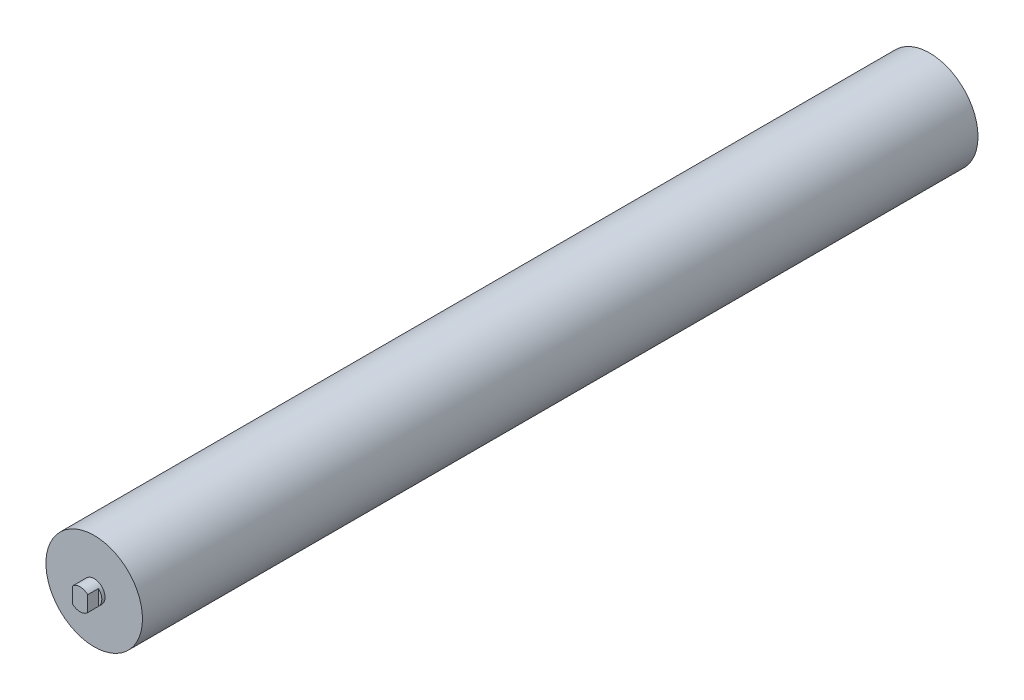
ISO-10303-21;
HEADER;
FILE_DESCRIPTION(('STEP AP214'),'2;1');
FILE_NAME('part.step','',(''),(''),'','','');
FILE_SCHEMA(('AUTOMOTIVE_DESIGN { 1 0 10303 214 1 1 1 1 }'));
ENDSEC;
DATA;
#1=APPLICATION_CONTEXT('core data for automotive mechanical design processes');
#2=APPLICATION_PROTOCOL_DEFINITION('international standard','automotive_design',2000,#1);
#3=PRODUCT_CONTEXT('',#1,'mechanical');
#4=PRODUCT('Part','Part','',(#3));
#5=PRODUCT_RELATED_PRODUCT_CATEGORY('part','',(#4));
#6=PRODUCT_DEFINITION_FORMATION('','',#4);
#7=PRODUCT_DEFINITION_CONTEXT('part definition',#1,'design');
#8=PRODUCT_DEFINITION('design','',#6,#7);
#9=PRODUCT_DEFINITION_SHAPE('','',#8);
#10=(LENGTH_UNIT() NAMED_UNIT(*) SI_UNIT(.MILLI.,.METRE.));
#11=(NAMED_UNIT(*) PLANE_ANGLE_UNIT() SI_UNIT($,.RADIAN.));
#12=(NAMED_UNIT(*) SI_UNIT($,.STERADIAN.) SOLID_ANGLE_UNIT());
#13=UNCERTAINTY_MEASURE_WITH_UNIT(LENGTH_MEASURE(1.E-05),#10,'distance_accuracy_value','');
#14=(GEOMETRIC_REPRESENTATION_CONTEXT(3) GLOBAL_UNCERTAINTY_ASSIGNED_CONTEXT((#13)) GLOBAL_UNIT_ASSIGNED_CONTEXT((#10,
#11,#12)) REPRESENTATION_CONTEXT('',''));
#15=CARTESIAN_POINT('',(0.,0.,0.));
#16=DIRECTION('',(0.,0.,1.));
#17=DIRECTION('',(1.,0.,0.));
#18=AXIS2_PLACEMENT_3D('',#15,#16,#17);
#19=CARTESIAN_POINT('',(0.,0.,783.));
#20=DIRECTION('',(0.,0.,-1.));
#21=DIRECTION('',(-1.,0.,0.));
#22=AXIS2_PLACEMENT_3D('',#19,#20,#21);
#23=CYLINDRICAL_SURFACE('',#22,10.);
#24=CARTESIAN_POINT('',(0.,0.,770.));
#25=DIRECTION('',(0.,0.,1.));
#26=DIRECTION('',(1.,0.,0.));
#27=AXIS2_PLACEMENT_3D('',#24,#25,#26);
#28=CIRCLE('',#27,10.);
#29=CARTESIAN_POINT('',(10.,0.,770.));
#30=VERTEX_POINT('',#29);
#31=EDGE_CURVE('E115',#30,#30,#28,.T.);
#32=ORIENTED_EDGE('',*,*,#31,.T.);
#33=EDGE_LOOP('',(#32));
#34=FACE_BOUND('',#33,.T.);
#35=DIRECTION('',(0.,0.,-1.));
#36=VECTOR('',#35,1.);
#37=CARTESIAN_POINT('',(-7.,7.14142842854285,783.));
#38=LINE('',#37,#36);
#39=CARTESIAN_POINT('',(-7.,7.14142842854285,783.));
#40=VERTEX_POINT('',#39);
#41=CARTESIAN_POINT('',(-7.,7.14142842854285,773.));
#42=VERTEX_POINT('',#41);
#43=EDGE_CURVE('E147',#40,#42,#38,.T.);
#44=ORIENTED_EDGE('',*,*,#43,.F.);
#45=CARTESIAN_POINT('',(0.,0.,783.));
#46=DIRECTION('',(0.,0.,1.));
#47=DIRECTION('',(1.,0.,0.));
#48=AXIS2_PLACEMENT_3D('',#45,#46,#47);
#49=CIRCLE('',#48,10.);
#50=CARTESIAN_POINT('',(7.,7.14142842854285,783.));
#51=VERTEX_POINT('',#50);
#52=EDGE_CURVE('E114',#51,#40,#49,.T.);
#53=ORIENTED_EDGE('',*,*,#52,.F.);
#54=DIRECTION('',(0.,0.,-1.));
#55=VECTOR('',#54,1.);
#56=CARTESIAN_POINT('',(7.,7.14142842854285,783.));
#57=LINE('',#56,#55);
#58=CARTESIAN_POINT('',(7.,7.14142842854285,773.));
#59=VERTEX_POINT('',#58);
#60=EDGE_CURVE('E55',#59,#51,#57,.F.);
#61=ORIENTED_EDGE('',*,*,#60,.F.);
#62=CARTESIAN_POINT('',(0.,0.,773.));
#63=DIRECTION('',(0.,0.,1.));
#64=DIRECTION('',(1.,0.,0.));
#65=AXIS2_PLACEMENT_3D('',#62,#63,#64);
#66=CIRCLE('',#65,10.);
#67=CARTESIAN_POINT('',(7.,-7.14142842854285,773.));
#68=VERTEX_POINT('',#67);
#69=EDGE_CURVE('E36',#68,#59,#66,.T.);
#70=ORIENTED_EDGE('',*,*,#69,.F.);
#71=DIRECTION('',(0.,0.,-1.));
#72=VECTOR('',#71,1.);
#73=CARTESIAN_POINT('',(7.,-7.14142842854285,783.));
#74=LINE('',#73,#72);
#75=CARTESIAN_POINT('',(7.,-7.14142842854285,783.));
#76=VERTEX_POINT('',#75);
#77=EDGE_CURVE('E98',#76,#68,#74,.T.);
#78=ORIENTED_EDGE('',*,*,#77,.F.);
#79=CARTESIAN_POINT('',(-7.,-7.14142842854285,783.));
#80=VERTEX_POINT('',#79);
#81=EDGE_CURVE('E111',#80,#76,#49,.T.);
#82=ORIENTED_EDGE('',*,*,#81,.F.);
#83=DIRECTION('',(0.,0.,-1.));
#84=VECTOR('',#83,1.);
#85=CARTESIAN_POINT('',(-7.,-7.14142842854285,783.));
#86=LINE('',#85,#84);
#87=CARTESIAN_POINT('',(-7.,-7.14142842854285,773.));
#88=VERTEX_POINT('',#87);
#89=EDGE_CURVE('E47',#88,#80,#86,.F.);
#90=ORIENTED_EDGE('',*,*,#89,.F.);
#91=EDGE_CURVE('E12',#42,#88,#66,.T.);
#92=ORIENTED_EDGE('',*,*,#91,.F.);
#93=EDGE_LOOP('',(#44,#53,#61,#70,#78,#82,#90,#92));
#94=FACE_BOUND('',#93,.T.);
#95=ADVANCED_FACE('F32',(#34,#94),#23,.T.);
#96=CARTESIAN_POINT('',(0.,0.,783.));
#97=DIRECTION('',(0.,0.,1.));
#98=DIRECTION('',(1.,0.,0.));
#99=AXIS2_PLACEMENT_3D('',#96,#97,#98);
#100=PLANE('',#99);
#101=ORIENTED_EDGE('',*,*,#52,.T.);
#102=DIRECTION('',(0.,-1.,0.));
#103=VECTOR('',#102,1.);
#104=CARTESIAN_POINT('',(-7.,0.,783.));
#105=LINE('',#104,#103);
#106=EDGE_CURVE('E104',#40,#80,#105,.T.);
#107=ORIENTED_EDGE('',*,*,#106,.T.);
#108=ORIENTED_EDGE('',*,*,#81,.T.);
#109=DIRECTION('',(0.,1.,0.));
#110=VECTOR('',#109,1.);
#111=CARTESIAN_POINT('',(7.,0.,783.));
#112=LINE('',#111,#110);
#113=EDGE_CURVE('E95',#76,#51,#112,.T.);
#114=ORIENTED_EDGE('',*,*,#113,.T.);
#115=EDGE_LOOP('',(#101,#107,#108,#114));
#116=FACE_BOUND('',#115,.T.);
#117=ADVANCED_FACE('F113',(#116),#100,.T.);
#118=CARTESIAN_POINT('',(0.,0.,-13.));
#119=DIRECTION('',(0.,0.,1.));
#120=DIRECTION('',(1.,0.,0.));
#121=AXIS2_PLACEMENT_3D('',#118,#119,#120);
#122=CYLINDRICAL_SURFACE('',#121,10.);
#123=CARTESIAN_POINT('',(0.,0.,0.));
#124=DIRECTION('',(0.,0.,1.));
#125=DIRECTION('',(1.,0.,0.));
#126=AXIS2_PLACEMENT_3D('',#123,#124,#125);
#127=CIRCLE('',#126,10.);
#128=CARTESIAN_POINT('',(10.,0.,0.));
#129=VERTEX_POINT('',#128);
#130=EDGE_CURVE('E128',#129,#129,#127,.F.);
#131=ORIENTED_EDGE('',*,*,#130,.T.);
#132=EDGE_LOOP('',(#131));
#133=FACE_BOUND('',#132,.T.);
#134=DIRECTION('',(0.,0.,1.));
#135=VECTOR('',#134,1.);
#136=CARTESIAN_POINT('',(7.,7.14142842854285,-13.));
#137=LINE('',#136,#135);
#138=CARTESIAN_POINT('',(7.,7.14142842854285,-13.));
#139=VERTEX_POINT('',#138);
#140=CARTESIAN_POINT('',(7.,7.14142842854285,-3.));
#141=VERTEX_POINT('',#140);
#142=EDGE_CURVE('E161',#139,#141,#137,.T.);
#143=ORIENTED_EDGE('',*,*,#142,.F.);
#144=CARTESIAN_POINT('',(0.,0.,-13.));
#145=DIRECTION('',(0.,0.,-1.));
#146=DIRECTION('',(-1.,0.,0.));
#147=AXIS2_PLACEMENT_3D('',#144,#145,#146);
#148=CIRCLE('',#147,10.);
#149=CARTESIAN_POINT('',(-7.,7.14142842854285,-13.));
#150=VERTEX_POINT('',#149);
#151=EDGE_CURVE('E119',#150,#139,#148,.T.);
#152=ORIENTED_EDGE('',*,*,#151,.F.);
#153=DIRECTION('',(0.,0.,1.));
#154=VECTOR('',#153,1.);
#155=CARTESIAN_POINT('',(-7.,7.14142842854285,-13.));
#156=LINE('',#155,#154);
#157=CARTESIAN_POINT('',(-7.,7.14142842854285,-3.));
#158=VERTEX_POINT('',#157);
#159=EDGE_CURVE('E155',#158,#150,#156,.F.);
#160=ORIENTED_EDGE('',*,*,#159,.F.);
#161=CARTESIAN_POINT('',(0.,0.,-3.00000000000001));
#162=DIRECTION('',(0.,0.,-1.));
#163=DIRECTION('',(-1.,0.,0.));
#164=AXIS2_PLACEMENT_3D('',#161,#162,#163);
#165=CIRCLE('',#164,10.);
#166=CARTESIAN_POINT('',(-7.,-7.14142842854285,-3.));
#167=VERTEX_POINT('',#166);
#168=EDGE_CURVE('E137',#167,#158,#165,.T.);
#169=ORIENTED_EDGE('',*,*,#168,.F.);
#170=DIRECTION('',(0.,0.,1.));
#171=VECTOR('',#170,1.);
#172=CARTESIAN_POINT('',(-7.,-7.14142842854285,-13.));
#173=LINE('',#172,#171);
#174=CARTESIAN_POINT('',(-7.,-7.14142842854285,-13.));
#175=VERTEX_POINT('',#174);
#176=EDGE_CURVE('E157',#175,#167,#173,.T.);
#177=ORIENTED_EDGE('',*,*,#176,.F.);
#178=CARTESIAN_POINT('',(7.,-7.14142842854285,-13.));
#179=VERTEX_POINT('',#178);
#180=EDGE_CURVE('E162',#179,#175,#148,.T.);
#181=ORIENTED_EDGE('',*,*,#180,.F.);
#182=DIRECTION('',(0.,0.,1.));
#183=VECTOR('',#182,1.);
#184=CARTESIAN_POINT('',(7.,-7.14142842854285,-13.));
#185=LINE('',#184,#183);
#186=CARTESIAN_POINT('',(7.,-7.14142842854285,-3.));
#187=VERTEX_POINT('',#186);
#188=EDGE_CURVE('E159',#187,#179,#185,.F.);
#189=ORIENTED_EDGE('',*,*,#188,.F.);
#190=EDGE_CURVE('E105',#141,#187,#165,.T.);
#191=ORIENTED_EDGE('',*,*,#190,.F.);
#192=EDGE_LOOP('',(#143,#152,#160,#169,#177,#181,#189,#191));
#193=FACE_BOUND('',#192,.T.);
#194=ADVANCED_FACE('F173',(#133,#193),#122,.T.);
#195=CARTESIAN_POINT('',(0.,0.,-13.));
#196=DIRECTION('',(0.,0.,-1.));
#197=DIRECTION('',(-1.,0.,0.));
#198=AXIS2_PLACEMENT_3D('',#195,#196,#197);
#199=PLANE('',#198);
#200=ORIENTED_EDGE('',*,*,#151,.T.);
#201=DIRECTION('',(0.,-1.,0.));
#202=VECTOR('',#201,1.);
#203=CARTESIAN_POINT('',(7.,0.,-13.));
#204=LINE('',#203,#202);
#205=EDGE_CURVE('E134',#139,#179,#204,.T.);
#206=ORIENTED_EDGE('',*,*,#205,.T.);
#207=ORIENTED_EDGE('',*,*,#180,.T.);
#208=DIRECTION('',(0.,1.,0.));
#209=VECTOR('',#208,1.);
#210=CARTESIAN_POINT('',(-7.,0.,-13.));
#211=LINE('',#210,#209);
#212=EDGE_CURVE('E131',#175,#150,#211,.T.);
#213=ORIENTED_EDGE('',*,*,#212,.T.);
#214=EDGE_LOOP('',(#200,#206,#207,#213));
#215=FACE_BOUND('',#214,.T.);
#216=ADVANCED_FACE('F168',(#215),#199,.T.);
#217=CARTESIAN_POINT('',(0.,0.,0.));
#218=DIRECTION('',(0.,0.,1.));
#219=DIRECTION('',(1.,0.,0.));
#220=AXIS2_PLACEMENT_3D('',#217,#218,#219);
#221=PLANE('',#220);
#222=CARTESIAN_POINT('',(0.,0.,0.));
#223=DIRECTION('',(0.,0.,1.));
#224=DIRECTION('',(1.,0.,0.));
#225=AXIS2_PLACEMENT_3D('',#222,#223,#224);
#226=CIRCLE('',#225,44.5);
#227=CARTESIAN_POINT('',(44.5,0.,0.));
#228=VERTEX_POINT('',#227);
#229=EDGE_CURVE('E117',#228,#228,#226,.T.);
#230=ORIENTED_EDGE('',*,*,#229,.F.);
#231=EDGE_LOOP('',(#230));
#232=FACE_BOUND('',#231,.T.);
#233=ORIENTED_EDGE('',*,*,#130,.F.);
#234=EDGE_LOOP('',(#233));
#235=FACE_BOUND('',#234,.T.);
#236=ADVANCED_FACE('F203',(#232,#235),#221,.F.);
#237=CARTESIAN_POINT('',(0.,0.,770.));
#238=DIRECTION('',(0.,0.,1.));
#239=DIRECTION('',(1.,0.,0.));
#240=AXIS2_PLACEMENT_3D('',#237,#238,#239);
#241=PLANE('',#240);
#242=CARTESIAN_POINT('',(0.,0.,770.));
#243=DIRECTION('',(0.,0.,1.));
#244=DIRECTION('',(1.,0.,0.));
#245=AXIS2_PLACEMENT_3D('',#242,#243,#244);
#246=CIRCLE('',#245,44.5);
#247=CARTESIAN_POINT('',(44.5,0.,770.));
#248=VERTEX_POINT('',#247);
#249=EDGE_CURVE('E125',#248,#248,#246,.T.);
#250=ORIENTED_EDGE('',*,*,#249,.T.);
#251=EDGE_LOOP('',(#250));
#252=FACE_BOUND('',#251,.T.);
#253=ORIENTED_EDGE('',*,*,#31,.F.);
#254=EDGE_LOOP('',(#253));
#255=FACE_BOUND('',#254,.T.);
#256=ADVANCED_FACE('F205',(#252,#255),#241,.T.);
#257=CARTESIAN_POINT('',(0.,0.,770.));
#258=DIRECTION('',(0.,0.,-1.));
#259=DIRECTION('',(-1.,0.,0.));
#260=AXIS2_PLACEMENT_3D('',#257,#258,#259);
#261=CYLINDRICAL_SURFACE('',#260,44.5);
#262=ORIENTED_EDGE('',*,*,#249,.F.);
#263=EDGE_LOOP('',(#262));
#264=FACE_BOUND('',#263,.T.);
#265=ORIENTED_EDGE('',*,*,#229,.T.);
#266=EDGE_LOOP('',(#265));
#267=FACE_BOUND('',#266,.T.);
#268=ADVANCED_FACE('F34',(#264,#267),#261,.T.);
#269=CARTESIAN_POINT('',(-7.,20.2682388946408,-3.));
#270=DIRECTION('',(-1.,0.,0.));
#271=DIRECTION('',(0.,-1.,0.));
#272=AXIS2_PLACEMENT_3D('',#269,#270,#271);
#273=PLANE('',#272);
#274=ORIENTED_EDGE('',*,*,#176,.T.);
#275=DIRECTION('',(0.,1.,0.));
#276=VECTOR('',#275,1.);
#277=CARTESIAN_POINT('',(-7.,20.2682388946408,-3.));
#278=LINE('',#277,#276);
#279=EDGE_CURVE('E152',#167,#158,#278,.T.);
#280=ORIENTED_EDGE('',*,*,#279,.T.);
#281=ORIENTED_EDGE('',*,*,#159,.T.);
#282=ORIENTED_EDGE('',*,*,#212,.F.);
#283=EDGE_LOOP('',(#274,#280,#281,#282));
#284=FACE_BOUND('',#283,.T.);
#285=ADVANCED_FACE('F179',(#284),#273,.T.);
#286=CARTESIAN_POINT('',(0.,0.,-3.00000000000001));
#287=DIRECTION('',(0.,0.,-1.));
#288=DIRECTION('',(-1.,0.,0.));
#289=AXIS2_PLACEMENT_3D('',#286,#287,#288);
#290=PLANE('',#289);
#291=ORIENTED_EDGE('',*,*,#168,.T.);
#292=ORIENTED_EDGE('',*,*,#279,.F.);
#293=EDGE_LOOP('',(#291,#292));
#294=FACE_BOUND('',#293,.T.);
#295=ADVANCED_FACE('F181',(#294),#290,.T.);
#296=ORIENTED_EDGE('',*,*,#190,.T.);
#297=DIRECTION('',(0.,-1.,0.));
#298=VECTOR('',#297,1.);
#299=CARTESIAN_POINT('',(7.,20.2682388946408,-3.));
#300=LINE('',#299,#298);
#301=EDGE_CURVE('E149',#141,#187,#300,.T.);
#302=ORIENTED_EDGE('',*,*,#301,.F.);
#303=EDGE_LOOP('',(#296,#302));
#304=FACE_BOUND('',#303,.T.);
#305=ADVANCED_FACE('F183',(#304),#290,.T.);
#306=CARTESIAN_POINT('',(7.,20.2682388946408,-3.));
#307=DIRECTION('',(1.,0.,0.));
#308=DIRECTION('',(0.,1.,0.));
#309=AXIS2_PLACEMENT_3D('',#306,#307,#308);
#310=PLANE('',#309);
#311=ORIENTED_EDGE('',*,*,#142,.T.);
#312=ORIENTED_EDGE('',*,*,#301,.T.);
#313=ORIENTED_EDGE('',*,*,#188,.T.);
#314=ORIENTED_EDGE('',*,*,#205,.F.);
#315=EDGE_LOOP('',(#311,#312,#313,#314));
#316=FACE_BOUND('',#315,.T.);
#317=ADVANCED_FACE('F189',(#316),#310,.T.);
#318=CARTESIAN_POINT('',(7.,19.7786679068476,773.));
#319=DIRECTION('',(1.,0.,0.));
#320=DIRECTION('',(0.,1.,0.));
#321=AXIS2_PLACEMENT_3D('',#318,#319,#320);
#322=PLANE('',#321);
#323=ORIENTED_EDGE('',*,*,#77,.T.);
#324=DIRECTION('',(0.,1.,0.));
#325=VECTOR('',#324,1.);
#326=CARTESIAN_POINT('',(7.,19.7786679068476,773.));
#327=LINE('',#326,#325);
#328=EDGE_CURVE('E140',#68,#59,#327,.T.);
#329=ORIENTED_EDGE('',*,*,#328,.T.);
#330=ORIENTED_EDGE('',*,*,#60,.T.);
#331=ORIENTED_EDGE('',*,*,#113,.F.);
#332=EDGE_LOOP('',(#323,#329,#330,#331));
#333=FACE_BOUND('',#332,.T.);
#334=ADVANCED_FACE('F97',(#333),#322,.T.);
#335=CARTESIAN_POINT('',(0.,0.,773.));
#336=DIRECTION('',(0.,0.,1.));
#337=DIRECTION('',(1.,0.,0.));
#338=AXIS2_PLACEMENT_3D('',#335,#336,#337);
#339=PLANE('',#338);
#340=ORIENTED_EDGE('',*,*,#69,.T.);
#341=ORIENTED_EDGE('',*,*,#328,.F.);
#342=EDGE_LOOP('',(#340,#341));
#343=FACE_BOUND('',#342,.T.);
#344=ADVANCED_FACE('F139',(#343),#339,.T.);
#345=ORIENTED_EDGE('',*,*,#91,.T.);
#346=DIRECTION('',(0.,-1.,0.));
#347=VECTOR('',#346,1.);
#348=CARTESIAN_POINT('',(-7.,19.7786679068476,773.));
#349=LINE('',#348,#347);
#350=EDGE_CURVE('E141',#42,#88,#349,.T.);
#351=ORIENTED_EDGE('',*,*,#350,.F.);
#352=EDGE_LOOP('',(#345,#351));
#353=FACE_BOUND('',#352,.T.);
#354=ADVANCED_FACE('F287',(#353),#339,.T.);
#355=CARTESIAN_POINT('',(-7.,19.7786679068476,773.));
#356=DIRECTION('',(-1.,0.,0.));
#357=DIRECTION('',(0.,-1.,0.));
#358=AXIS2_PLACEMENT_3D('',#355,#356,#357);
#359=PLANE('',#358);
#360=ORIENTED_EDGE('',*,*,#43,.T.);
#361=ORIENTED_EDGE('',*,*,#350,.T.);
#362=ORIENTED_EDGE('',*,*,#89,.T.);
#363=ORIENTED_EDGE('',*,*,#106,.F.);
#364=EDGE_LOOP('',(#360,#361,#362,#363));
#365=FACE_BOUND('',#364,.T.);
#366=ADVANCED_FACE('F295',(#365),#359,.T.);
#367=CLOSED_SHELL('',(#95,#117,#194,#216,#236,#256,#268,#285,#295,#305,#317,#334,#344,#354,#366));
#368=MANIFOLD_SOLID_BREP('B2',#367);
#369=ADVANCED_BREP_SHAPE_REPRESENTATION('',(#18,#368),#14);
#370=SHAPE_DEFINITION_REPRESENTATION(#9,#369);
ENDSEC;
END-ISO-10303-21;
